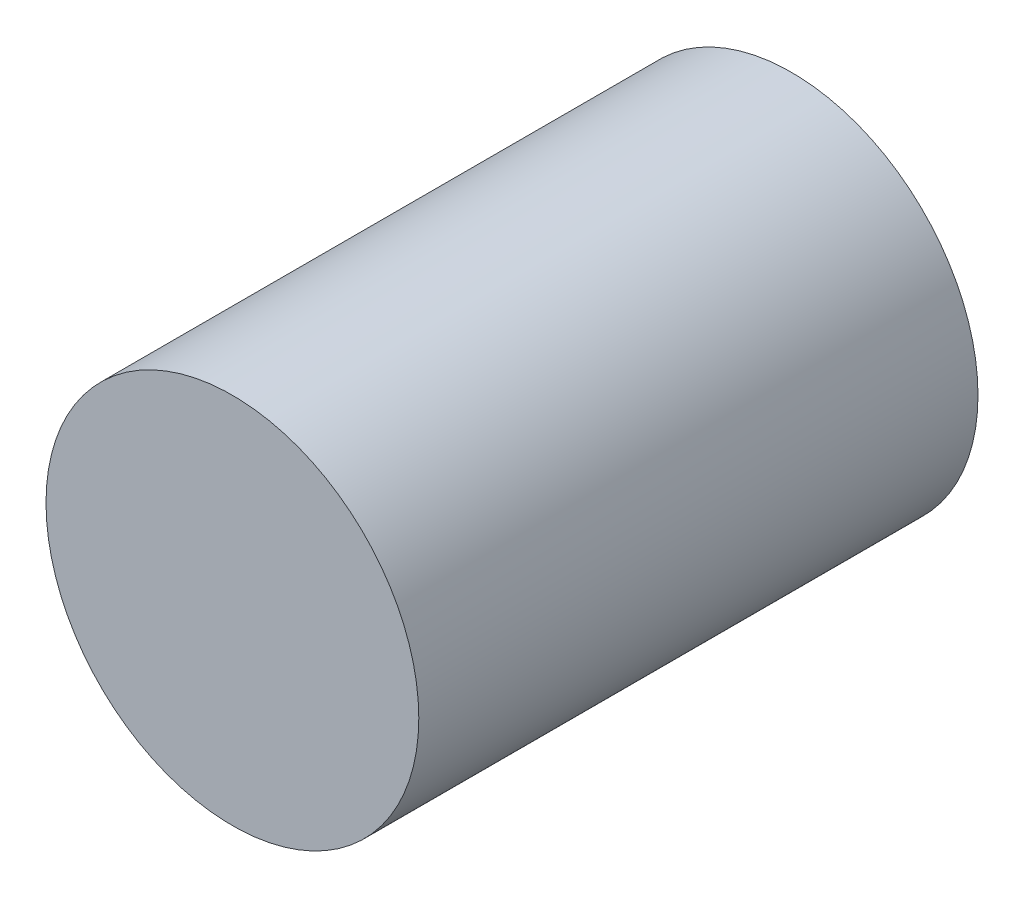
ISO-10303-21;
HEADER;
FILE_DESCRIPTION(('STEP AP214'),'2;1');
FILE_NAME('part.step','',(''),(''),'','','');
FILE_SCHEMA(('AUTOMOTIVE_DESIGN { 1 0 10303 214 1 1 1 1 }'));
ENDSEC;
DATA;
#1=APPLICATION_CONTEXT('core data for automotive mechanical design processes');
#2=APPLICATION_PROTOCOL_DEFINITION('international standard','automotive_design',2000,#1);
#3=PRODUCT_CONTEXT('',#1,'mechanical');
#4=PRODUCT('Part','Part','',(#3));
#5=PRODUCT_RELATED_PRODUCT_CATEGORY('part','',(#4));
#6=PRODUCT_DEFINITION_FORMATION('','',#4);
#7=PRODUCT_DEFINITION_CONTEXT('part definition',#1,'design');
#8=PRODUCT_DEFINITION('design','',#6,#7);
#9=PRODUCT_DEFINITION_SHAPE('','',#8);
#10=(LENGTH_UNIT() NAMED_UNIT(*) SI_UNIT(.MILLI.,.METRE.));
#11=(NAMED_UNIT(*) PLANE_ANGLE_UNIT() SI_UNIT($,.RADIAN.));
#12=(NAMED_UNIT(*) SI_UNIT($,.STERADIAN.) SOLID_ANGLE_UNIT());
#13=UNCERTAINTY_MEASURE_WITH_UNIT(LENGTH_MEASURE(1.E-05),#10,'distance_accuracy_value','');
#14=(GEOMETRIC_REPRESENTATION_CONTEXT(3) GLOBAL_UNCERTAINTY_ASSIGNED_CONTEXT((#13)) GLOBAL_UNIT_ASSIGNED_CONTEXT((#10,
#11,#12)) REPRESENTATION_CONTEXT('',''));
#15=CARTESIAN_POINT('',(0.,0.,0.));
#16=DIRECTION('',(0.,0.,1.));
#17=DIRECTION('',(1.,0.,0.));
#18=AXIS2_PLACEMENT_3D('',#15,#16,#17);
#19=CARTESIAN_POINT('',(0.,0.,76.2));
#20=DIRECTION('',(0.,0.,-1.));
#21=DIRECTION('',(-1.,0.,0.));
#22=AXIS2_PLACEMENT_3D('',#19,#20,#21);
#23=CYLINDRICAL_SURFACE('',#22,50.8);
#24=CARTESIAN_POINT('',(0.,0.,76.2));
#25=DIRECTION('',(0.,0.,1.));
#26=DIRECTION('',(1.,0.,0.));
#27=AXIS2_PLACEMENT_3D('',#24,#25,#26);
#28=CIRCLE('',#27,50.8);
#29=CARTESIAN_POINT('',(-50.8,0.,76.2));
#30=VERTEX_POINT('',#29);
#31=EDGE_CURVE('E10',#30,#30,#28,.T.);
#32=CARTESIAN_POINT('',(0.,0.,-76.2));
#33=DIRECTION('',(0.,0.,1.));
#34=DIRECTION('',(1.,0.,0.));
#35=AXIS2_PLACEMENT_3D('',#32,#33,#34);
#36=CIRCLE('',#35,50.8);
#37=CARTESIAN_POINT('',(-50.8,0.,-76.2));
#38=VERTEX_POINT('',#37);
#39=EDGE_CURVE('E31',#38,#38,#36,.T.);
#40=CARTESIAN_POINT('',(-50.8,0.,76.2));
#41=CARTESIAN_POINT('',(-50.8,0.,74.6125));
#42=CARTESIAN_POINT('',(-50.8,0.,73.025));
#43=CARTESIAN_POINT('',(-50.8,0.,69.85));
#44=CARTESIAN_POINT('',(-50.8,0.,68.2625));
#45=CARTESIAN_POINT('',(-50.8,0.,65.0875));
#46=CARTESIAN_POINT('',(-50.8,0.,63.5));
#47=CARTESIAN_POINT('',(-50.8,0.,60.325));
#48=CARTESIAN_POINT('',(-50.8,0.,58.7375));
#49=CARTESIAN_POINT('',(-50.8,0.,55.5625));
#50=CARTESIAN_POINT('',(-50.8,0.,53.975));
#51=CARTESIAN_POINT('',(-50.8,0.,50.8));
#52=CARTESIAN_POINT('',(-50.8,0.,49.2125));
#53=CARTESIAN_POINT('',(-50.8,0.,46.0375));
#54=CARTESIAN_POINT('',(-50.8,0.,44.45));
#55=CARTESIAN_POINT('',(-50.8,0.,41.275));
#56=CARTESIAN_POINT('',(-50.8,0.,39.6875));
#57=CARTESIAN_POINT('',(-50.8,0.,36.5125));
#58=CARTESIAN_POINT('',(-50.8,0.,34.925));
#59=CARTESIAN_POINT('',(-50.8,0.,31.75));
#60=CARTESIAN_POINT('',(-50.8,0.,30.1625));
#61=CARTESIAN_POINT('',(-50.8,0.,26.9875));
#62=CARTESIAN_POINT('',(-50.8,0.,25.4));
#63=CARTESIAN_POINT('',(-50.8,0.,22.225));
#64=CARTESIAN_POINT('',(-50.8,0.,20.6375));
#65=CARTESIAN_POINT('',(-50.8,0.,17.4625));
#66=CARTESIAN_POINT('',(-50.8,0.,15.875));
#67=CARTESIAN_POINT('',(-50.8,0.,12.7));
#68=CARTESIAN_POINT('',(-50.8,0.,11.1125));
#69=CARTESIAN_POINT('',(-50.8,0.,7.93750000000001));
#70=CARTESIAN_POINT('',(-50.8,0.,6.35));
#71=CARTESIAN_POINT('',(-50.8,0.,3.175));
#72=CARTESIAN_POINT('',(-50.8,0.,1.5875));
#73=CARTESIAN_POINT('',(-50.8,0.,-1.5875));
#74=CARTESIAN_POINT('',(-50.8,0.,-3.175));
#75=CARTESIAN_POINT('',(-50.8,0.,-6.35));
#76=CARTESIAN_POINT('',(-50.8,0.,-7.93750000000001));
#77=CARTESIAN_POINT('',(-50.8,0.,-11.1125));
#78=CARTESIAN_POINT('',(-50.8,0.,-12.7));
#79=CARTESIAN_POINT('',(-50.8,0.,-15.875));
#80=CARTESIAN_POINT('',(-50.8,0.,-17.4625));
#81=CARTESIAN_POINT('',(-50.8,0.,-20.6375));
#82=CARTESIAN_POINT('',(-50.8,0.,-22.225));
#83=CARTESIAN_POINT('',(-50.8,0.,-25.4));
#84=CARTESIAN_POINT('',(-50.8,0.,-26.9875));
#85=CARTESIAN_POINT('',(-50.8,0.,-30.1625));
#86=CARTESIAN_POINT('',(-50.8,0.,-31.75));
#87=CARTESIAN_POINT('',(-50.8,0.,-34.925));
#88=CARTESIAN_POINT('',(-50.8,0.,-36.5125));
#89=CARTESIAN_POINT('',(-50.8,0.,-39.6875));
#90=CARTESIAN_POINT('',(-50.8,0.,-41.275));
#91=CARTESIAN_POINT('',(-50.8,0.,-44.45));
#92=CARTESIAN_POINT('',(-50.8,0.,-46.0375));
#93=CARTESIAN_POINT('',(-50.8,0.,-49.2125));
#94=CARTESIAN_POINT('',(-50.8,0.,-50.8));
#95=CARTESIAN_POINT('',(-50.8,0.,-53.975));
#96=CARTESIAN_POINT('',(-50.8,0.,-55.5625));
#97=CARTESIAN_POINT('',(-50.8,0.,-58.7375));
#98=CARTESIAN_POINT('',(-50.8,0.,-60.325));
#99=CARTESIAN_POINT('',(-50.8,0.,-63.5));
#100=CARTESIAN_POINT('',(-50.8,0.,-65.0875));
#101=CARTESIAN_POINT('',(-50.8,0.,-68.2625));
#102=CARTESIAN_POINT('',(-50.8,0.,-69.85));
#103=CARTESIAN_POINT('',(-50.8,0.,-73.025));
#104=CARTESIAN_POINT('',(-50.8,0.,-74.6125));
#105=CARTESIAN_POINT('',(-50.8,0.,-76.2));
#106=B_SPLINE_CURVE_WITH_KNOTS('',3,(#40,#41,#42,#43,#44,#45,#46,#47,#48,#49,#50,#51,#52,#53,
#54,#55,#56,#57,#58,#59,#60,#61,#62,#63,#64,#65,#66,#67,#68,#69,#70,#71,#72,#73,#74,#75,#76,#77,
#78,#79,#80,#81,#82,#83,#84,#85,#86,#87,#88,#89,#90,#91,#92,#93,#94,#95,#96,#97,#98,#99,#100,
#101,#102,#103,#104,#105),.UNSPECIFIED.,.F.,.F.,(4,2,2,2,2,2,2,2,2,2,2,2,2,2,2,2,2,2,2,2,2,2,2,
2,2,2,2,2,2,2,2,2,4),(0.,4.7625,9.52500000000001,14.2875,19.05,23.8125,28.575,33.3375,38.1,
42.8625,47.625,52.3875,57.15,61.9125,66.675,71.4375,76.2,80.9625,85.725,90.4875,95.25,100.0125,
104.775,109.5375,114.3,119.0625,123.825,128.5875,133.35,138.1125,142.875,147.6375,152.4),.UNSPECIFIED.);
#107=EDGE_CURVE('BSEAM28',#30,#38,#106,.T.);
#108=ORIENTED_EDGE('',*,*,#31,.F.);
#109=ORIENTED_EDGE('',*,*,#39,.T.);
#110=ORIENTED_EDGE('',*,*,#107,.T.);
#111=ORIENTED_EDGE('',*,*,#107,.F.);
#112=EDGE_LOOP('',(#108,#110,#109,#111));
#113=FACE_BOUND('',#112,.T.);
#114=ADVANCED_FACE('F28',(#113),#23,.T.);
#115=CARTESIAN_POINT('',(0.,0.,76.2));
#116=DIRECTION('',(0.,0.,1.));
#117=DIRECTION('',(1.,0.,0.));
#118=AXIS2_PLACEMENT_3D('',#115,#116,#117);
#119=PLANE('',#118);
#120=ORIENTED_EDGE('',*,*,#31,.T.);
#121=EDGE_LOOP('',(#120));
#122=FACE_BOUND('',#121,.T.);
#123=ADVANCED_FACE('F43',(#122),#119,.T.);
#124=CARTESIAN_POINT('',(0.,0.,-76.2));
#125=DIRECTION('',(0.,0.,1.));
#126=DIRECTION('',(1.,0.,0.));
#127=AXIS2_PLACEMENT_3D('',#124,#125,#126);
#128=PLANE('',#127);
#129=ORIENTED_EDGE('',*,*,#39,.F.);
#130=EDGE_LOOP('',(#129));
#131=FACE_BOUND('',#130,.T.);
#132=ADVANCED_FACE('F41',(#131),#128,.F.);
#133=CLOSED_SHELL('',(#114,#123,#132));
#134=MANIFOLD_SOLID_BREP('B2',#133);
#135=ADVANCED_BREP_SHAPE_REPRESENTATION('',(#18,#134),#14);
#136=SHAPE_DEFINITION_REPRESENTATION(#9,#135);
ENDSEC;
END-ISO-10303-21;
